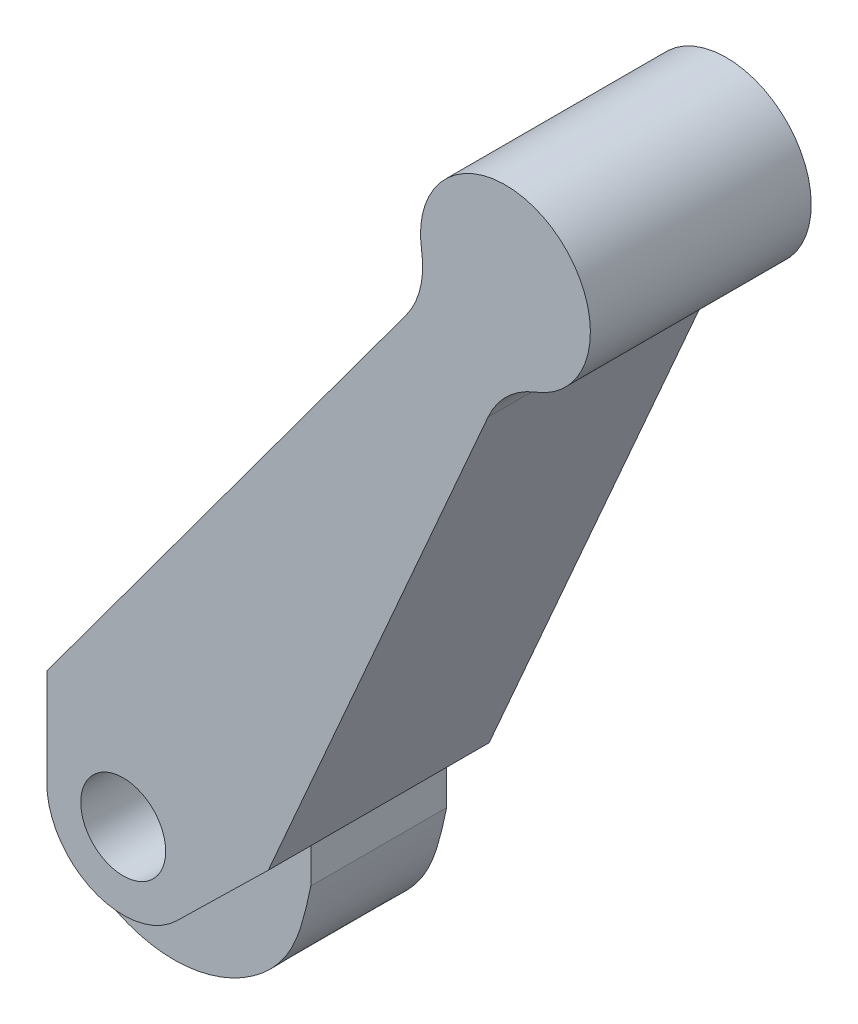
ISO-10303-21;
HEADER;
FILE_DESCRIPTION(('STEP AP214'),'2;1');
FILE_NAME('part.step','',(''),(''),'','','');
FILE_SCHEMA(('AUTOMOTIVE_DESIGN { 1 0 10303 214 1 1 1 1 }'));
ENDSEC;
DATA;
#1=APPLICATION_CONTEXT('core data for automotive mechanical design processes');
#2=APPLICATION_PROTOCOL_DEFINITION('international standard','automotive_design',2000,#1);
#3=PRODUCT_CONTEXT('',#1,'mechanical');
#4=PRODUCT('Part','Part','',(#3));
#5=PRODUCT_RELATED_PRODUCT_CATEGORY('part','',(#4));
#6=PRODUCT_DEFINITION_FORMATION('','',#4);
#7=PRODUCT_DEFINITION_CONTEXT('part definition',#1,'design');
#8=PRODUCT_DEFINITION('design','',#6,#7);
#9=PRODUCT_DEFINITION_SHAPE('','',#8);
#10=(LENGTH_UNIT() NAMED_UNIT(*) SI_UNIT(.MILLI.,.METRE.));
#11=(NAMED_UNIT(*) PLANE_ANGLE_UNIT() SI_UNIT($,.RADIAN.));
#12=(NAMED_UNIT(*) SI_UNIT($,.STERADIAN.) SOLID_ANGLE_UNIT());
#13=UNCERTAINTY_MEASURE_WITH_UNIT(LENGTH_MEASURE(1.E-05),#10,'distance_accuracy_value','');
#14=(GEOMETRIC_REPRESENTATION_CONTEXT(3) GLOBAL_UNCERTAINTY_ASSIGNED_CONTEXT((#13)) GLOBAL_UNIT_ASSIGNED_CONTEXT((#10,
#11,#12)) REPRESENTATION_CONTEXT('',''));
#15=CARTESIAN_POINT('',(0.,0.,0.));
#16=DIRECTION('',(0.,0.,1.));
#17=DIRECTION('',(1.,0.,0.));
#18=AXIS2_PLACEMENT_3D('',#15,#16,#17);
#19=CARTESIAN_POINT('',(0.599531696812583,-7.78400928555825,-4.));
#20=DIRECTION('',(0.,0.,-1.));
#21=DIRECTION('',(-1.,0.,0.));
#22=AXIS2_PLACEMENT_3D('',#19,#20,#21);
#23=PLANE('',#22);
#24=DIRECTION('',(-0.59306094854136,-0.80515756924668,0.));
#25=VECTOR('',#24,1.);
#26=CARTESIAN_POINT('',(-5.63610298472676,4.15142663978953,-4.));
#27=LINE('',#26,#25);
#28=CARTESIAN_POINT('',(-4.5,5.69383458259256,-4.));
#29=VERTEX_POINT('',#28);
#30=CARTESIAN_POINT('',(-5.63610298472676,4.15142663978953,-4.));
#31=VERTEX_POINT('',#30);
#32=EDGE_CURVE('E206',#29,#31,#27,.T.);
#33=ORIENTED_EDGE('',*,*,#32,.F.);
#34=DIRECTION('',(0.,-1.,0.));
#35=VECTOR('',#34,1.);
#36=CARTESIAN_POINT('',(-4.5,0.,-4.));
#37=LINE('',#36,#35);
#38=CARTESIAN_POINT('',(-4.5,0.,-4.));
#39=VERTEX_POINT('',#38);
#40=EDGE_CURVE('E144',#29,#39,#37,.T.);
#41=ORIENTED_EDGE('',*,*,#40,.T.);
#42=CARTESIAN_POINT('',(0.,0.,-4.));
#43=DIRECTION('',(0.,0.,1.));
#44=DIRECTION('',(1.,0.,0.));
#45=AXIS2_PLACEMENT_3D('',#42,#43,#44);
#46=CIRCLE('',#45,4.5);
#47=CARTESIAN_POINT('',(3.14605311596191,-3.21750676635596,-4.));
#48=VERTEX_POINT('',#47);
#49=EDGE_CURVE('E125',#39,#48,#46,.T.);
#50=ORIENTED_EDGE('',*,*,#49,.T.);
#51=DIRECTION('',(0.715001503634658,0.699122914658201,0.));
#52=VECTOR('',#51,1.);
#53=CARTESIAN_POINT('',(3.14605311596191,-3.21750676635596,-4.));
#54=LINE('',#53,#52);
#55=CARTESIAN_POINT('',(8.54,2.05665258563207,-4.));
#56=VERTEX_POINT('',#55);
#57=EDGE_CURVE('E136',#48,#56,#54,.T.);
#58=ORIENTED_EDGE('',*,*,#57,.T.);
#59=DIRECTION('',(0.,1.,0.));
#60=VECTOR('',#59,1.);
#61=CARTESIAN_POINT('',(8.54,0.,-4.));
#62=LINE('',#61,#60);
#63=CARTESIAN_POINT('',(8.54,0.,-4.));
#64=VERTEX_POINT('',#63);
#65=EDGE_CURVE('E201',#64,#56,#62,.T.);
#66=ORIENTED_EDGE('',*,*,#65,.F.);
#67=CARTESIAN_POINT('',(-7.,0.,-4.));
#68=CARTESIAN_POINT('',(-6.88967515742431,-1.25635650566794,-4.));
#69=CARTESIAN_POINT('',(-6.66507059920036,-3.81410679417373,-4.));
#70=CARTESIAN_POINT('',(-3.8892652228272,-6.82792815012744,-4.));
#71=CARTESIAN_POINT('',(0.0222339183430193,-8.13729403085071,-4.));
#72=CARTESIAN_POINT('',(4.19946018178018,-7.26693167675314,-4.));
#73=CARTESIAN_POINT('',(7.62414314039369,-4.32247644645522,-4.));
#74=CARTESIAN_POINT('',(8.23158779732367,-1.45558169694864,-4.));
#75=CARTESIAN_POINT('',(8.54,0.,-4.));
#76=B_SPLINE_CURVE_WITH_KNOTS('',3,(#67,#68,#69,#70,#71,#72,#73,#74,#75),.UNSPECIFIED.,.F.,.F.,
(4,1,1,1,1,1,4),(0.,0.152956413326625,0.311395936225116,0.475319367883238,0.644727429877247,
0.819620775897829,1.),.UNSPECIFIED.);
#77=CARTESIAN_POINT('',(-7.,0.,-4.));
#78=VERTEX_POINT('',#77);
#79=EDGE_CURVE('E196',#78,#64,#76,.T.);
#80=ORIENTED_EDGE('',*,*,#79,.F.);
#81=CARTESIAN_POINT('',(0.,0.,-4.));
#82=DIRECTION('',(0.,0.,1.));
#83=DIRECTION('',(1.,0.,0.));
#84=AXIS2_PLACEMENT_3D('',#81,#82,#83);
#85=CIRCLE('',#84,7.);
#86=EDGE_CURVE('E209',#31,#78,#85,.T.);
#87=ORIENTED_EDGE('',*,*,#86,.F.);
#88=EDGE_LOOP('',(#33,#41,#50,#58,#66,#80,#87));
#89=FACE_BOUND('',#88,.T.);
#90=ADVANCED_FACE('F14',(#89),#23,.T.);
#91=CARTESIAN_POINT('',(0.599531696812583,-7.78400928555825,4.));
#92=DIRECTION('',(0.,0.,-1.));
#93=DIRECTION('',(-1.,0.,0.));
#94=AXIS2_PLACEMENT_3D('',#91,#92,#93);
#95=PLANE('',#94);
#96=DIRECTION('',(0.715001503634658,0.699122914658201,0.));
#97=VECTOR('',#96,1.);
#98=CARTESIAN_POINT('',(3.14605311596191,-3.21750676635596,4.));
#99=LINE('',#98,#97);
#100=CARTESIAN_POINT('',(3.14605311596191,-3.21750676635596,4.));
#101=VERTEX_POINT('',#100);
#102=CARTESIAN_POINT('',(8.54,2.05665258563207,4.));
#103=VERTEX_POINT('',#102);
#104=EDGE_CURVE('E170',#101,#103,#99,.T.);
#105=ORIENTED_EDGE('',*,*,#104,.F.);
#106=CARTESIAN_POINT('',(0.,0.,4.));
#107=DIRECTION('',(0.,0.,1.));
#108=DIRECTION('',(1.,0.,0.));
#109=AXIS2_PLACEMENT_3D('',#106,#107,#108);
#110=CIRCLE('',#109,4.5);
#111=CARTESIAN_POINT('',(-4.5,0.,4.));
#112=VERTEX_POINT('',#111);
#113=EDGE_CURVE('E167',#112,#101,#110,.T.);
#114=ORIENTED_EDGE('',*,*,#113,.F.);
#115=DIRECTION('',(0.,-1.,0.));
#116=VECTOR('',#115,1.);
#117=CARTESIAN_POINT('',(-4.5,0.,4.));
#118=LINE('',#117,#116);
#119=CARTESIAN_POINT('',(-4.5,5.69383458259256,4.));
#120=VERTEX_POINT('',#119);
#121=EDGE_CURVE('E166',#120,#112,#118,.T.);
#122=ORIENTED_EDGE('',*,*,#121,.F.);
#123=DIRECTION('',(-0.59306094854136,-0.80515756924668,0.));
#124=VECTOR('',#123,1.);
#125=CARTESIAN_POINT('',(-5.63610298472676,4.15142663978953,4.));
#126=LINE('',#125,#124);
#127=CARTESIAN_POINT('',(-5.63610298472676,4.15142663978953,4.));
#128=VERTEX_POINT('',#127);
#129=EDGE_CURVE('E287',#120,#128,#126,.T.);
#130=ORIENTED_EDGE('',*,*,#129,.T.);
#131=CARTESIAN_POINT('',(0.,0.,4.));
#132=DIRECTION('',(0.,0.,1.));
#133=DIRECTION('',(1.,0.,0.));
#134=AXIS2_PLACEMENT_3D('',#131,#132,#133);
#135=CIRCLE('',#134,7.);
#136=CARTESIAN_POINT('',(-7.,0.,4.));
#137=VERTEX_POINT('',#136);
#138=EDGE_CURVE('E290',#128,#137,#135,.T.);
#139=ORIENTED_EDGE('',*,*,#138,.T.);
#140=CARTESIAN_POINT('',(-7.,0.,4.));
#141=CARTESIAN_POINT('',(-6.88967515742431,-1.25635650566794,4.));
#142=CARTESIAN_POINT('',(-6.66507059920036,-3.81410679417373,4.));
#143=CARTESIAN_POINT('',(-3.8892652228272,-6.82792815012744,4.));
#144=CARTESIAN_POINT('',(0.0222339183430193,-8.13729403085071,4.));
#145=CARTESIAN_POINT('',(4.19946018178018,-7.26693167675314,4.));
#146=CARTESIAN_POINT('',(7.62414314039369,-4.32247644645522,4.));
#147=CARTESIAN_POINT('',(8.23158779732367,-1.45558169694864,4.));
#148=CARTESIAN_POINT('',(8.54,0.,4.));
#149=B_SPLINE_CURVE_WITH_KNOTS('',3,(#140,#141,#142,#143,#144,#145,#146,#147,#148),
.UNSPECIFIED.,.F.,.F.,(4,1,1,1,1,1,4),(0.,0.152956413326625,0.311395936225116,0.475319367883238,
0.644727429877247,0.819620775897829,1.),.UNSPECIFIED.);
#150=CARTESIAN_POINT('',(8.54,0.,4.));
#151=VERTEX_POINT('',#150);
#152=EDGE_CURVE('E303',#137,#151,#149,.T.);
#153=ORIENTED_EDGE('',*,*,#152,.T.);
#154=DIRECTION('',(0.,1.,0.));
#155=VECTOR('',#154,1.);
#156=CARTESIAN_POINT('',(8.54,0.,4.));
#157=LINE('',#156,#155);
#158=EDGE_CURVE('E291',#151,#103,#157,.T.);
#159=ORIENTED_EDGE('',*,*,#158,.T.);
#160=EDGE_LOOP('',(#105,#114,#122,#130,#139,#153,#159));
#161=FACE_BOUND('',#160,.T.);
#162=ADVANCED_FACE('F309',(#161),#95,.F.);
#163=DIRECTION('',(0.,0.,-1.));
#164=VECTOR('',#163,1.);
#165=SURFACE_OF_LINEAR_EXTRUSION('',#149,#164);
#166=ORIENTED_EDGE('',*,*,#79,.T.);
#167=DIRECTION('',(0.,0.,-1.));
#168=VECTOR('',#167,1.);
#169=CARTESIAN_POINT('',(8.54,0.,4.));
#170=LINE('',#169,#168);
#171=EDGE_CURVE('E226',#151,#64,#170,.T.);
#172=ORIENTED_EDGE('',*,*,#171,.F.);
#173=ORIENTED_EDGE('',*,*,#152,.F.);
#174=DIRECTION('',(0.,0.,-1.));
#175=VECTOR('',#174,1.);
#176=CARTESIAN_POINT('',(-7.,0.,4.));
#177=LINE('',#176,#175);
#178=EDGE_CURVE('E283',#137,#78,#177,.T.);
#179=ORIENTED_EDGE('',*,*,#178,.T.);
#180=EDGE_LOOP('',(#166,#172,#173,#179));
#181=FACE_BOUND('',#180,.T.);
#182=ADVANCED_FACE('F16',(#181),#165,.F.);
#183=CARTESIAN_POINT('',(8.54,0.,4.));
#184=DIRECTION('',(-1.,0.,0.));
#185=DIRECTION('',(0.,0.,1.));
#186=AXIS2_PLACEMENT_3D('',#183,#184,#185);
#187=PLANE('',#186);
#188=ORIENTED_EDGE('',*,*,#65,.T.);
#189=DIRECTION('',(0.,0.,-1.));
#190=VECTOR('',#189,1.);
#191=CARTESIAN_POINT('',(8.54,2.05665258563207,4.));
#192=LINE('',#191,#190);
#193=EDGE_CURVE('E276',#103,#56,#192,.T.);
#194=ORIENTED_EDGE('',*,*,#193,.F.);
#195=ORIENTED_EDGE('',*,*,#158,.F.);
#196=ORIENTED_EDGE('',*,*,#171,.T.);
#197=EDGE_LOOP('',(#188,#194,#195,#196));
#198=FACE_BOUND('',#197,.T.);
#199=ADVANCED_FACE('F307',(#198),#187,.F.);
#200=CARTESIAN_POINT('',(8.54,2.05665258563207,4.));
#201=DIRECTION('',(-0.91618463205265,0.400756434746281,0.));
#202=DIRECTION('',(-0.400756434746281,-0.91618463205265,0.));
#203=AXIS2_PLACEMENT_3D('',#200,#201,#202);
#204=PLANE('',#203);
#205=DIRECTION('',(0.400756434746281,0.91618463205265,0.));
#206=VECTOR('',#205,1.);
#207=CARTESIAN_POINT('',(8.54,2.05665258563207,-6.5));
#208=LINE('',#207,#206);
#209=CARTESIAN_POINT('',(8.54,2.05665258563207,-6.5));
#210=VERTEX_POINT('',#209);
#211=CARTESIAN_POINT('',(21.4753475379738,31.6286459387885,-6.5));
#212=VERTEX_POINT('',#211);
#213=EDGE_CURVE('E152',#210,#212,#208,.T.);
#214=ORIENTED_EDGE('',*,*,#213,.T.);
#215=DIRECTION('',(0.,0.,1.));
#216=VECTOR('',#215,1.);
#217=CARTESIAN_POINT('',(21.4753475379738,31.6286459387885,6.5));
#218=LINE('',#217,#216);
#219=CARTESIAN_POINT('',(21.4753475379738,31.6286459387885,6.5));
#220=VERTEX_POINT('',#219);
#221=EDGE_CURVE('E229',#212,#220,#218,.T.);
#222=ORIENTED_EDGE('',*,*,#221,.T.);
#223=DIRECTION('',(0.400756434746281,0.91618463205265,0.));
#224=VECTOR('',#223,1.);
#225=CARTESIAN_POINT('',(8.54,2.05665258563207,6.5));
#226=LINE('',#225,#224);
#227=CARTESIAN_POINT('',(8.54,2.05665258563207,6.5));
#228=VERTEX_POINT('',#227);
#229=EDGE_CURVE('E183',#228,#220,#226,.T.);
#230=ORIENTED_EDGE('',*,*,#229,.F.);
#231=DIRECTION('',(0.,0.,-1.));
#232=VECTOR('',#231,1.);
#233=CARTESIAN_POINT('',(8.54,2.05665258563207,6.5));
#234=LINE('',#233,#232);
#235=EDGE_CURVE('E186',#228,#103,#234,.T.);
#236=ORIENTED_EDGE('',*,*,#235,.T.);
#237=ORIENTED_EDGE('',*,*,#193,.T.);
#238=DIRECTION('',(0.,0.,1.));
#239=VECTOR('',#238,1.);
#240=CARTESIAN_POINT('',(8.54,2.05665258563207,-6.5));
#241=LINE('',#240,#239);
#242=EDGE_CURVE('E132',#210,#56,#241,.T.);
#243=ORIENTED_EDGE('',*,*,#242,.F.);
#244=EDGE_LOOP('',(#214,#222,#230,#236,#237,#243));
#245=FACE_BOUND('',#244,.T.);
#246=ADVANCED_FACE('F273',(#245),#204,.F.);
#247=CARTESIAN_POINT('',(22.5,38.9711431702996,4.));
#248=DIRECTION('',(0.,0.,-1.));
#249=DIRECTION('',(-1.,0.,0.));
#250=AXIS2_PLACEMENT_3D('',#247,#248,#249);
#251=CYLINDRICAL_SURFACE('',#250,5.);
#252=CARTESIAN_POINT('',(22.5,38.9711431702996,6.5));
#253=DIRECTION('',(0.,0.,1.));
#254=DIRECTION('',(1.,0.,0.));
#255=AXIS2_PLACEMENT_3D('',#252,#253,#254);
#256=CIRCLE('',#255,5.);
#257=CARTESIAN_POINT('',(24.2781353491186,34.2980034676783,6.5));
#258=VERTEX_POINT('',#257);
#259=CARTESIAN_POINT('',(17.5638746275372,38.1744837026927,6.5));
#260=VERTEX_POINT('',#259);
#261=EDGE_CURVE('E173',#258,#260,#256,.T.);
#262=ORIENTED_EDGE('',*,*,#261,.F.);
#263=DIRECTION('',(0.,0.,-1.));
#264=VECTOR('',#263,1.);
#265=CARTESIAN_POINT('',(24.2781353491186,34.2980034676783,4.));
#266=LINE('',#265,#264);
#267=CARTESIAN_POINT('',(24.2781353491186,34.2980034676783,-6.5));
#268=VERTEX_POINT('',#267);
#269=EDGE_CURVE('E225',#258,#268,#266,.T.);
#270=ORIENTED_EDGE('',*,*,#269,.T.);
#271=CARTESIAN_POINT('',(22.5,38.9711431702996,-6.5));
#272=DIRECTION('',(0.,0.,1.));
#273=DIRECTION('',(1.,0.,0.));
#274=AXIS2_PLACEMENT_3D('',#271,#272,#273);
#275=CIRCLE('',#274,5.);
#276=CARTESIAN_POINT('',(17.5638746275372,38.1744837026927,-6.5));
#277=VERTEX_POINT('',#276);
#278=EDGE_CURVE('E146',#268,#277,#275,.T.);
#279=ORIENTED_EDGE('',*,*,#278,.T.);
#280=DIRECTION('',(0.,0.,-1.));
#281=VECTOR('',#280,1.);
#282=CARTESIAN_POINT('',(17.5638746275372,38.1744837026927,4.));
#283=LINE('',#282,#281);
#284=EDGE_CURVE('E223',#277,#260,#283,.F.);
#285=ORIENTED_EDGE('',*,*,#284,.T.);
#286=EDGE_LOOP('',(#262,#270,#279,#285));
#287=FACE_BOUND('',#286,.T.);
#288=ADVANCED_FACE('F243',(#287),#251,.T.);
#289=CARTESIAN_POINT('',(-5.63610298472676,4.15142663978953,4.));
#290=DIRECTION('',(0.80515756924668,-0.59306094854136,0.));
#291=DIRECTION('',(0.59306094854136,0.80515756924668,0.));
#292=AXIS2_PLACEMENT_3D('',#289,#290,#291);
#293=PLANE('',#292);
#294=DIRECTION('',(-0.59306094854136,-0.80515756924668,0.));
#295=VECTOR('',#294,1.);
#296=CARTESIAN_POINT('',(18.169872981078,36.4711431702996,6.5));
#297=LINE('',#296,#295);
#298=CARTESIAN_POINT('',(16.6535371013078,34.412519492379,6.5));
#299=VERTEX_POINT('',#298);
#300=CARTESIAN_POINT('',(-4.5,5.69383458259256,6.5));
#301=VERTEX_POINT('',#300);
#302=EDGE_CURVE('E175',#299,#301,#297,.T.);
#303=ORIENTED_EDGE('',*,*,#302,.F.);
#304=DIRECTION('',(0.,0.,1.));
#305=VECTOR('',#304,1.);
#306=CARTESIAN_POINT('',(16.6535371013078,34.412519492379,-6.5));
#307=LINE('',#306,#305);
#308=CARTESIAN_POINT('',(16.6535371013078,34.412519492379,-6.5));
#309=VERTEX_POINT('',#308);
#310=EDGE_CURVE('E231',#299,#309,#307,.F.);
#311=ORIENTED_EDGE('',*,*,#310,.T.);
#312=DIRECTION('',(-0.59306094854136,-0.80515756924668,0.));
#313=VECTOR('',#312,1.);
#314=CARTESIAN_POINT('',(18.169872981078,36.4711431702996,-6.5));
#315=LINE('',#314,#313);
#316=CARTESIAN_POINT('',(-4.5,5.69383458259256,-6.5));
#317=VERTEX_POINT('',#316);
#318=EDGE_CURVE('E161',#309,#317,#315,.T.);
#319=ORIENTED_EDGE('',*,*,#318,.T.);
#320=DIRECTION('',(0.,0.,1.));
#321=VECTOR('',#320,1.);
#322=CARTESIAN_POINT('',(-4.5,5.69383458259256,-6.5));
#323=LINE('',#322,#321);
#324=EDGE_CURVE('E163',#317,#29,#323,.T.);
#325=ORIENTED_EDGE('',*,*,#324,.T.);
#326=ORIENTED_EDGE('',*,*,#32,.T.);
#327=DIRECTION('',(0.,0.,-1.));
#328=VECTOR('',#327,1.);
#329=CARTESIAN_POINT('',(-5.63610298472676,4.15142663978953,4.));
#330=LINE('',#329,#328);
#331=EDGE_CURVE('E278',#128,#31,#330,.T.);
#332=ORIENTED_EDGE('',*,*,#331,.F.);
#333=ORIENTED_EDGE('',*,*,#129,.F.);
#334=DIRECTION('',(0.,0.,-1.));
#335=VECTOR('',#334,1.);
#336=CARTESIAN_POINT('',(-4.5,5.69383458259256,6.5));
#337=LINE('',#336,#335);
#338=EDGE_CURVE('E195',#301,#120,#337,.T.);
#339=ORIENTED_EDGE('',*,*,#338,.F.);
#340=EDGE_LOOP('',(#303,#311,#319,#325,#326,#332,#333,#339));
#341=FACE_BOUND('',#340,.T.);
#342=ADVANCED_FACE('F247',(#341),#293,.F.);
#343=CARTESIAN_POINT('',(0.,0.,4.));
#344=DIRECTION('',(0.,0.,-1.));
#345=DIRECTION('',(-1.,0.,0.));
#346=AXIS2_PLACEMENT_3D('',#343,#344,#345);
#347=CYLINDRICAL_SURFACE('',#346,7.);
#348=ORIENTED_EDGE('',*,*,#86,.T.);
#349=ORIENTED_EDGE('',*,*,#178,.F.);
#350=ORIENTED_EDGE('',*,*,#138,.F.);
#351=ORIENTED_EDGE('',*,*,#331,.T.);
#352=EDGE_LOOP('',(#348,#349,#350,#351));
#353=FACE_BOUND('',#352,.T.);
#354=ADVANCED_FACE('F316',(#353),#347,.T.);
#355=CARTESIAN_POINT('',(-4.5,0.,6.5));
#356=DIRECTION('',(1.,0.,0.));
#357=DIRECTION('',(0.,1.,0.));
#358=AXIS2_PLACEMENT_3D('',#355,#356,#357);
#359=PLANE('',#358);
#360=ORIENTED_EDGE('',*,*,#121,.T.);
#361=DIRECTION('',(0.,0.,-1.));
#362=VECTOR('',#361,1.);
#363=CARTESIAN_POINT('',(-4.5,0.,6.5));
#364=LINE('',#363,#362);
#365=CARTESIAN_POINT('',(-4.5,0.,6.5));
#366=VERTEX_POINT('',#365);
#367=EDGE_CURVE('E192',#366,#112,#364,.T.);
#368=ORIENTED_EDGE('',*,*,#367,.F.);
#369=DIRECTION('',(0.,-1.,0.));
#370=VECTOR('',#369,1.);
#371=CARTESIAN_POINT('',(-4.5,0.,6.5));
#372=LINE('',#371,#370);
#373=EDGE_CURVE('E177',#301,#366,#372,.T.);
#374=ORIENTED_EDGE('',*,*,#373,.F.);
#375=ORIENTED_EDGE('',*,*,#338,.T.);
#376=EDGE_LOOP('',(#360,#368,#374,#375));
#377=FACE_BOUND('',#376,.T.);
#378=ADVANCED_FACE('F259',(#377),#359,.F.);
#379=CARTESIAN_POINT('',(0.,0.,6.5));
#380=DIRECTION('',(0.,0.,-1.));
#381=DIRECTION('',(-1.,0.,0.));
#382=AXIS2_PLACEMENT_3D('',#379,#380,#381);
#383=CYLINDRICAL_SURFACE('',#382,4.5);
#384=ORIENTED_EDGE('',*,*,#113,.T.);
#385=DIRECTION('',(0.,0.,-1.));
#386=VECTOR('',#385,1.);
#387=CARTESIAN_POINT('',(3.14605311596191,-3.21750676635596,6.5));
#388=LINE('',#387,#386);
#389=CARTESIAN_POINT('',(3.14605311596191,-3.21750676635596,6.5));
#390=VERTEX_POINT('',#389);
#391=EDGE_CURVE('E189',#390,#101,#388,.T.);
#392=ORIENTED_EDGE('',*,*,#391,.F.);
#393=CARTESIAN_POINT('',(0.,0.,6.5));
#394=DIRECTION('',(0.,0.,1.));
#395=DIRECTION('',(1.,0.,0.));
#396=AXIS2_PLACEMENT_3D('',#393,#394,#395);
#397=CIRCLE('',#396,4.5);
#398=EDGE_CURVE('E179',#366,#390,#397,.T.);
#399=ORIENTED_EDGE('',*,*,#398,.F.);
#400=ORIENTED_EDGE('',*,*,#367,.T.);
#401=EDGE_LOOP('',(#384,#392,#399,#400));
#402=FACE_BOUND('',#401,.T.);
#403=ADVANCED_FACE('F261',(#402),#383,.T.);
#404=CARTESIAN_POINT('',(3.14605311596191,-3.21750676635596,6.5));
#405=DIRECTION('',(-0.699122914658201,0.715001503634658,0.));
#406=DIRECTION('',(-0.715001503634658,-0.699122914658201,0.));
#407=AXIS2_PLACEMENT_3D('',#404,#405,#406);
#408=PLANE('',#407);
#409=ORIENTED_EDGE('',*,*,#104,.T.);
#410=ORIENTED_EDGE('',*,*,#235,.F.);
#411=DIRECTION('',(0.715001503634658,0.699122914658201,0.));
#412=VECTOR('',#411,1.);
#413=CARTESIAN_POINT('',(3.14605311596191,-3.21750676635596,6.5));
#414=LINE('',#413,#412);
#415=EDGE_CURVE('E181',#390,#228,#414,.T.);
#416=ORIENTED_EDGE('',*,*,#415,.F.);
#417=ORIENTED_EDGE('',*,*,#391,.T.);
#418=EDGE_LOOP('',(#409,#410,#416,#417));
#419=FACE_BOUND('',#418,.T.);
#420=ADVANCED_FACE('F265',(#419),#408,.F.);
#421=CARTESIAN_POINT('',(22.5,38.9711431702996,6.5));
#422=DIRECTION('',(0.,0.,1.));
#423=DIRECTION('',(1.,0.,0.));
#424=AXIS2_PLACEMENT_3D('',#421,#422,#423);
#425=PLANE('',#424);
#426=CARTESIAN_POINT('',(0.,0.,6.5));
#427=DIRECTION('',(0.,0.,1.));
#428=DIRECTION('',(1.,0.,0.));
#429=AXIS2_PLACEMENT_3D('',#426,#427,#428);
#430=CIRCLE('',#429,2.5);
#431=CARTESIAN_POINT('',(2.5,0.,6.5));
#432=VERTEX_POINT('',#431);
#433=EDGE_CURVE('E140',#432,#432,#430,.T.);
#434=ORIENTED_EDGE('',*,*,#433,.F.);
#435=EDGE_LOOP('',(#434));
#436=FACE_BOUND('',#435,.T.);
#437=ORIENTED_EDGE('',*,*,#229,.T.);
#438=CARTESIAN_POINT('',(26.056270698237,29.6248637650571,6.5));
#439=DIRECTION('',(0.,0.,1.));
#440=DIRECTION('',(1.,0.,0.));
#441=AXIS2_PLACEMENT_3D('',#438,#439,#440);
#442=CIRCLE('',#441,5.);
#443=EDGE_CURVE('E235',#220,#258,#442,.F.);
#444=ORIENTED_EDGE('',*,*,#443,.T.);
#445=ORIENTED_EDGE('',*,*,#261,.T.);
#446=CARTESIAN_POINT('',(12.6277492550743,37.3778242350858,6.5));
#447=DIRECTION('',(0.,0.,1.));
#448=DIRECTION('',(1.,0.,0.));
#449=AXIS2_PLACEMENT_3D('',#446,#447,#448);
#450=CIRCLE('',#449,5.);
#451=EDGE_CURVE('E9',#260,#299,#450,.F.);
#452=ORIENTED_EDGE('',*,*,#451,.T.);
#453=ORIENTED_EDGE('',*,*,#302,.T.);
#454=ORIENTED_EDGE('',*,*,#373,.T.);
#455=ORIENTED_EDGE('',*,*,#398,.T.);
#456=ORIENTED_EDGE('',*,*,#415,.T.);
#457=EDGE_LOOP('',(#437,#444,#445,#452,#453,#454,#455,#456));
#458=FACE_BOUND('',#457,.T.);
#459=ADVANCED_FACE('F253',(#436,#458),#425,.T.);
#460=CARTESIAN_POINT('',(3.14605311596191,-3.21750676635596,-6.5));
#461=DIRECTION('',(0.699122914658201,-0.715001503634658,0.));
#462=DIRECTION('',(0.715001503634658,0.699122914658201,0.));
#463=AXIS2_PLACEMENT_3D('',#460,#461,#462);
#464=PLANE('',#463);
#465=ORIENTED_EDGE('',*,*,#57,.F.);
#466=DIRECTION('',(0.,0.,1.));
#467=VECTOR('',#466,1.);
#468=CARTESIAN_POINT('',(3.14605311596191,-3.21750676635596,-6.5));
#469=LINE('',#468,#467);
#470=CARTESIAN_POINT('',(3.14605311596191,-3.21750676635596,-6.5));
#471=VERTEX_POINT('',#470);
#472=EDGE_CURVE('E121',#471,#48,#469,.T.);
#473=ORIENTED_EDGE('',*,*,#472,.F.);
#474=DIRECTION('',(0.715001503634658,0.699122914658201,0.));
#475=VECTOR('',#474,1.);
#476=CARTESIAN_POINT('',(3.14605311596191,-3.21750676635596,-6.5));
#477=LINE('',#476,#475);
#478=EDGE_CURVE('E155',#471,#210,#477,.T.);
#479=ORIENTED_EDGE('',*,*,#478,.T.);
#480=ORIENTED_EDGE('',*,*,#242,.T.);
#481=EDGE_LOOP('',(#465,#473,#479,#480));
#482=FACE_BOUND('',#481,.T.);
#483=ADVANCED_FACE('F137',(#482),#464,.T.);
#484=CARTESIAN_POINT('',(0.,0.,-6.5));
#485=DIRECTION('',(0.,0.,1.));
#486=DIRECTION('',(1.,0.,0.));
#487=AXIS2_PLACEMENT_3D('',#484,#485,#486);
#488=CYLINDRICAL_SURFACE('',#487,4.5);
#489=ORIENTED_EDGE('',*,*,#49,.F.);
#490=DIRECTION('',(0.,0.,1.));
#491=VECTOR('',#490,1.);
#492=CARTESIAN_POINT('',(-4.5,0.,-6.5));
#493=LINE('',#492,#491);
#494=CARTESIAN_POINT('',(-4.5,0.,-6.5));
#495=VERTEX_POINT('',#494);
#496=EDGE_CURVE('E133',#495,#39,#493,.T.);
#497=ORIENTED_EDGE('',*,*,#496,.F.);
#498=CARTESIAN_POINT('',(0.,0.,-6.5));
#499=DIRECTION('',(0.,0.,1.));
#500=DIRECTION('',(1.,0.,0.));
#501=AXIS2_PLACEMENT_3D('',#498,#499,#500);
#502=CIRCLE('',#501,4.5);
#503=EDGE_CURVE('E128',#495,#471,#502,.T.);
#504=ORIENTED_EDGE('',*,*,#503,.T.);
#505=ORIENTED_EDGE('',*,*,#472,.T.);
#506=EDGE_LOOP('',(#489,#497,#504,#505));
#507=FACE_BOUND('',#506,.T.);
#508=ADVANCED_FACE('F123',(#507),#488,.T.);
#509=CARTESIAN_POINT('',(-4.5,0.,-6.5));
#510=DIRECTION('',(-1.,0.,0.));
#511=DIRECTION('',(0.,-1.,0.));
#512=AXIS2_PLACEMENT_3D('',#509,#510,#511);
#513=PLANE('',#512);
#514=ORIENTED_EDGE('',*,*,#40,.F.);
#515=ORIENTED_EDGE('',*,*,#324,.F.);
#516=DIRECTION('',(0.,-1.,0.));
#517=VECTOR('',#516,1.);
#518=CARTESIAN_POINT('',(-4.5,0.,-6.5));
#519=LINE('',#518,#517);
#520=EDGE_CURVE('E158',#317,#495,#519,.T.);
#521=ORIENTED_EDGE('',*,*,#520,.T.);
#522=ORIENTED_EDGE('',*,*,#496,.T.);
#523=EDGE_LOOP('',(#514,#515,#521,#522));
#524=FACE_BOUND('',#523,.T.);
#525=ADVANCED_FACE('F319',(#524),#513,.T.);
#526=CARTESIAN_POINT('',(22.5,38.9711431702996,-6.5));
#527=DIRECTION('',(0.,0.,-1.));
#528=DIRECTION('',(1.,0.,0.));
#529=AXIS2_PLACEMENT_3D('',#526,#527,#528);
#530=PLANE('',#529);
#531=CARTESIAN_POINT('',(0.,0.,-6.5));
#532=DIRECTION('',(0.,0.,-1.));
#533=DIRECTION('',(-1.,0.,0.));
#534=AXIS2_PLACEMENT_3D('',#531,#532,#533);
#535=CIRCLE('',#534,2.5);
#536=CARTESIAN_POINT('',(-2.5,0.,-6.5));
#537=VERTEX_POINT('',#536);
#538=EDGE_CURVE('E220',#537,#537,#535,.T.);
#539=ORIENTED_EDGE('',*,*,#538,.F.);
#540=EDGE_LOOP('',(#539));
#541=FACE_BOUND('',#540,.T.);
#542=ORIENTED_EDGE('',*,*,#278,.F.);
#543=CARTESIAN_POINT('',(26.056270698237,29.6248637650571,-6.5));
#544=DIRECTION('',(0.,0.,-1.));
#545=DIRECTION('',(-1.,0.,0.));
#546=AXIS2_PLACEMENT_3D('',#543,#544,#545);
#547=CIRCLE('',#546,5.);
#548=EDGE_CURVE('E233',#268,#212,#547,.F.);
#549=ORIENTED_EDGE('',*,*,#548,.T.);
#550=ORIENTED_EDGE('',*,*,#213,.F.);
#551=ORIENTED_EDGE('',*,*,#478,.F.);
#552=ORIENTED_EDGE('',*,*,#503,.F.);
#553=ORIENTED_EDGE('',*,*,#520,.F.);
#554=ORIENTED_EDGE('',*,*,#318,.F.);
#555=CARTESIAN_POINT('',(12.6277492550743,37.3778242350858,-6.5));
#556=DIRECTION('',(0.,0.,-1.));
#557=DIRECTION('',(-1.,0.,0.));
#558=AXIS2_PLACEMENT_3D('',#555,#556,#557);
#559=CIRCLE('',#558,5.);
#560=EDGE_CURVE('E23',#309,#277,#559,.F.);
#561=ORIENTED_EDGE('',*,*,#560,.T.);
#562=EDGE_LOOP('',(#542,#549,#550,#551,#552,#553,#554,#561));
#563=FACE_BOUND('',#562,.T.);
#564=ADVANCED_FACE('F239',(#541,#563),#530,.T.);
#565=CARTESIAN_POINT('',(0.,0.,-7.25));
#566=DIRECTION('',(0.,0.,1.));
#567=DIRECTION('',(1.,0.,0.));
#568=AXIS2_PLACEMENT_3D('',#565,#566,#567);
#569=CYLINDRICAL_SURFACE('',#568,2.5);
#570=ORIENTED_EDGE('',*,*,#433,.T.);
#571=EDGE_LOOP('',(#570));
#572=FACE_BOUND('',#571,.T.);
#573=ORIENTED_EDGE('',*,*,#538,.T.);
#574=EDGE_LOOP('',(#573));
#575=FACE_BOUND('',#574,.T.);
#576=ADVANCED_FACE('F328',(#572,#575),#569,.F.);
#577=CARTESIAN_POINT('',(26.056270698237,29.6248637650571,4.));
#578=DIRECTION('',(0.,0.,-1.));
#579=DIRECTION('',(-1.,0.,0.));
#580=AXIS2_PLACEMENT_3D('',#577,#578,#579);
#581=CYLINDRICAL_SURFACE('',#580,5.);
#582=ORIENTED_EDGE('',*,*,#443,.F.);
#583=ORIENTED_EDGE('',*,*,#221,.F.);
#584=ORIENTED_EDGE('',*,*,#548,.F.);
#585=ORIENTED_EDGE('',*,*,#269,.F.);
#586=EDGE_LOOP('',(#582,#583,#584,#585));
#587=FACE_BOUND('',#586,.T.);
#588=ADVANCED_FACE('F271',(#587),#581,.F.);
#589=CARTESIAN_POINT('',(12.6277492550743,37.3778242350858,4.));
#590=DIRECTION('',(0.,0.,-1.));
#591=DIRECTION('',(-1.,0.,0.));
#592=AXIS2_PLACEMENT_3D('',#589,#590,#591);
#593=CYLINDRICAL_SURFACE('',#592,5.);
#594=ORIENTED_EDGE('',*,*,#451,.F.);
#595=ORIENTED_EDGE('',*,*,#284,.F.);
#596=ORIENTED_EDGE('',*,*,#560,.F.);
#597=ORIENTED_EDGE('',*,*,#310,.F.);
#598=EDGE_LOOP('',(#594,#595,#596,#597));
#599=FACE_BOUND('',#598,.T.);
#600=ADVANCED_FACE('F245',(#599),#593,.F.);
#601=CLOSED_SHELL('',(#90,#162,#182,#199,#246,#288,#342,#354,#378,#403,#420,#459,#483,#508,#525,
#564,#576,#588,#600));
#602=MANIFOLD_SOLID_BREP('B1',#601);
#603=ADVANCED_BREP_SHAPE_REPRESENTATION('',(#18,#602),#14);
#604=SHAPE_DEFINITION_REPRESENTATION(#9,#603);
ENDSEC;
END-ISO-10303-21;
